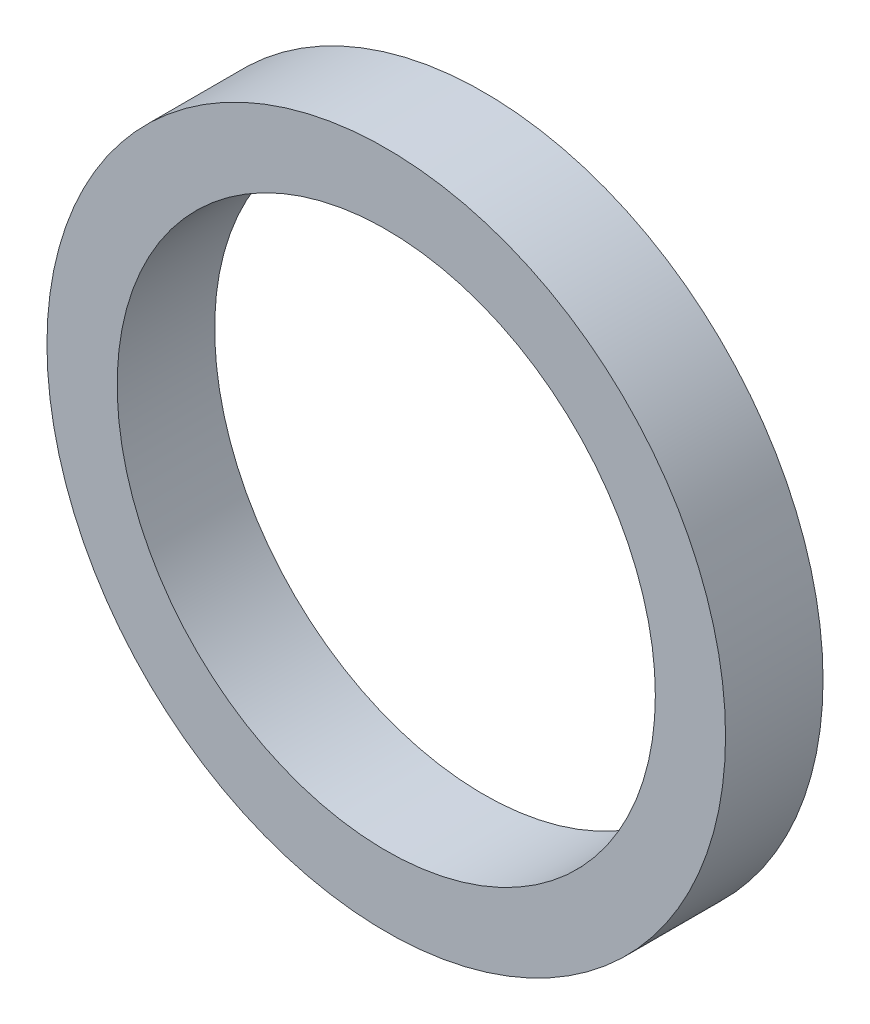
from build123d import *

# Parameters (mm, degrees)
SKETCH1_R          = 11.049
SKETCH1_R_2        = 8.763
BASE_EXTRUDE_DEPTH = 3.175


with BuildPart() as part:
    # Sketch1 → Base-Extrude (new body)
    with BuildSketch(Plane.XY):
        Circle(SKETCH1_R)
        Circle(SKETCH1_R_2, mode=Mode.SUBTRACT)
    extrude(amount=BASE_EXTRUDE_DEPTH)


solid = part.part
